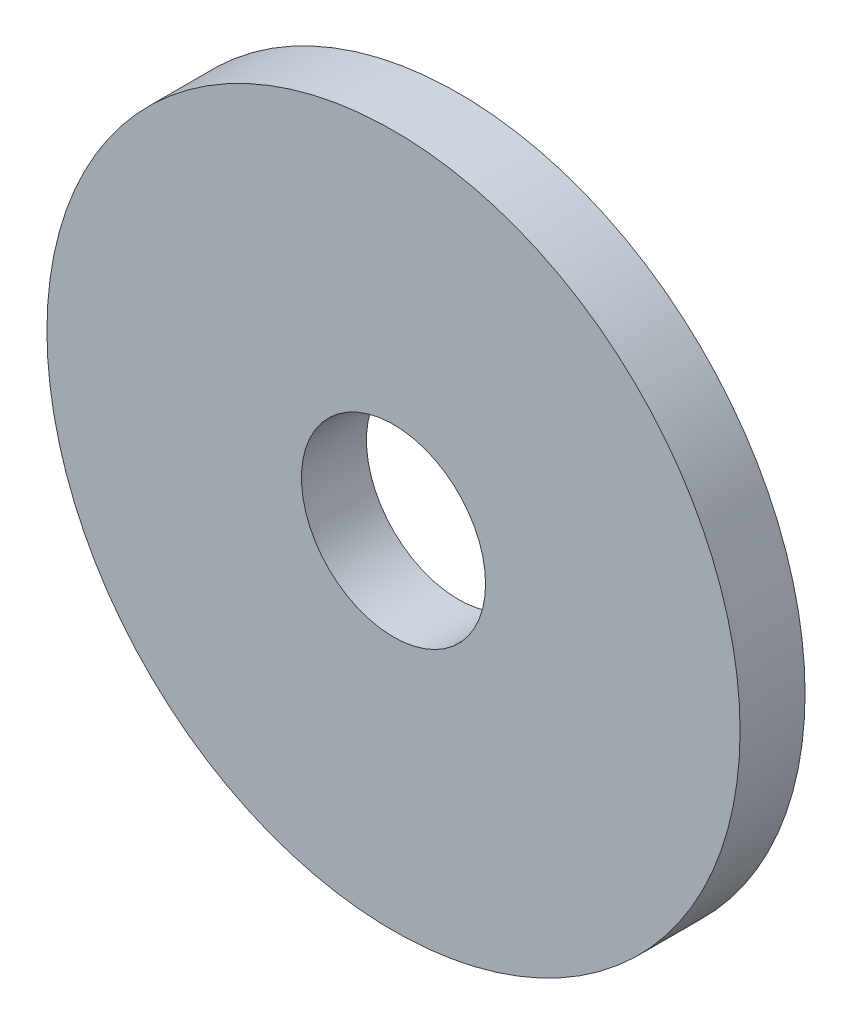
ISO-10303-21;
HEADER;
FILE_DESCRIPTION(('STEP AP214'),'2;1');
FILE_NAME('part.step','',(''),(''),'','','');
FILE_SCHEMA(('AUTOMOTIVE_DESIGN { 1 0 10303 214 1 1 1 1 }'));
ENDSEC;
DATA;
#1=APPLICATION_CONTEXT('core data for automotive mechanical design processes');
#2=APPLICATION_PROTOCOL_DEFINITION('international standard','automotive_design',2000,#1);
#3=PRODUCT_CONTEXT('',#1,'mechanical');
#4=PRODUCT('Part','Part','',(#3));
#5=PRODUCT_RELATED_PRODUCT_CATEGORY('part','',(#4));
#6=PRODUCT_DEFINITION_FORMATION('','',#4);
#7=PRODUCT_DEFINITION_CONTEXT('part definition',#1,'design');
#8=PRODUCT_DEFINITION('design','',#6,#7);
#9=PRODUCT_DEFINITION_SHAPE('','',#8);
#10=(LENGTH_UNIT() NAMED_UNIT(*) SI_UNIT(.MILLI.,.METRE.));
#11=(NAMED_UNIT(*) PLANE_ANGLE_UNIT() SI_UNIT($,.RADIAN.));
#12=(NAMED_UNIT(*) SI_UNIT($,.STERADIAN.) SOLID_ANGLE_UNIT());
#13=UNCERTAINTY_MEASURE_WITH_UNIT(LENGTH_MEASURE(1.E-05),#10,'distance_accuracy_value','');
#14=(GEOMETRIC_REPRESENTATION_CONTEXT(3) GLOBAL_UNCERTAINTY_ASSIGNED_CONTEXT((#13)) GLOBAL_UNIT_ASSIGNED_CONTEXT((#10,
#11,#12)) REPRESENTATION_CONTEXT('',''));
#15=CARTESIAN_POINT('',(0.,0.,0.));
#16=DIRECTION('',(0.,0.,1.));
#17=DIRECTION('',(1.,0.,0.));
#18=AXIS2_PLACEMENT_3D('',#15,#16,#17);
#19=CARTESIAN_POINT('',(0.,0.,3.));
#20=DIRECTION('',(0.,0.,1.));
#21=DIRECTION('',(1.,0.,0.));
#22=AXIS2_PLACEMENT_3D('',#19,#20,#21);
#23=PLANE('',#22);
#24=CARTESIAN_POINT('',(0.,0.,3.));
#25=DIRECTION('',(0.,0.,1.));
#26=DIRECTION('',(1.,0.,0.));
#27=AXIS2_PLACEMENT_3D('',#24,#25,#26);
#28=CIRCLE('',#27,16.);
#29=CARTESIAN_POINT('',(16.,0.,3.));
#30=VERTEX_POINT('',#29);
#31=EDGE_CURVE('E10',#30,#30,#28,.T.);
#32=ORIENTED_EDGE('',*,*,#31,.T.);
#33=EDGE_LOOP('',(#32));
#34=FACE_BOUND('',#33,.T.);
#35=CARTESIAN_POINT('',(0.,0.,3.));
#36=DIRECTION('',(0.,0.,1.));
#37=DIRECTION('',(1.,0.,0.));
#38=AXIS2_PLACEMENT_3D('',#35,#36,#37);
#39=CIRCLE('',#38,4.25);
#40=CARTESIAN_POINT('',(4.25,0.,3.));
#41=VERTEX_POINT('',#40);
#42=EDGE_CURVE('E45',#41,#41,#39,.T.);
#43=ORIENTED_EDGE('',*,*,#42,.F.);
#44=EDGE_LOOP('',(#43));
#45=FACE_BOUND('',#44,.T.);
#46=ADVANCED_FACE('F34',(#34,#45),#23,.T.);
#47=CARTESIAN_POINT('',(0.,0.,0.));
#48=DIRECTION('',(0.,0.,1.));
#49=DIRECTION('',(1.,0.,0.));
#50=AXIS2_PLACEMENT_3D('',#47,#48,#49);
#51=PLANE('',#50);
#52=CARTESIAN_POINT('',(0.,0.,0.));
#53=DIRECTION('',(0.,0.,1.));
#54=DIRECTION('',(1.,0.,0.));
#55=AXIS2_PLACEMENT_3D('',#52,#53,#54);
#56=CIRCLE('',#55,16.);
#57=CARTESIAN_POINT('',(16.,0.,0.));
#58=VERTEX_POINT('',#57);
#59=EDGE_CURVE('E38',#58,#58,#56,.T.);
#60=ORIENTED_EDGE('',*,*,#59,.F.);
#61=EDGE_LOOP('',(#60));
#62=FACE_BOUND('',#61,.T.);
#63=CARTESIAN_POINT('',(0.,0.,0.));
#64=DIRECTION('',(0.,0.,1.));
#65=DIRECTION('',(1.,0.,0.));
#66=AXIS2_PLACEMENT_3D('',#63,#64,#65);
#67=CIRCLE('',#66,4.25);
#68=CARTESIAN_POINT('',(4.25,0.,0.));
#69=VERTEX_POINT('',#68);
#70=EDGE_CURVE('E47',#69,#69,#67,.T.);
#71=ORIENTED_EDGE('',*,*,#70,.T.);
#72=EDGE_LOOP('',(#71));
#73=FACE_BOUND('',#72,.T.);
#74=ADVANCED_FACE('F57',(#62,#73),#51,.F.);
#75=CARTESIAN_POINT('',(0.,0.,3.));
#76=DIRECTION('',(0.,0.,-1.));
#77=DIRECTION('',(-1.,0.,0.));
#78=AXIS2_PLACEMENT_3D('',#75,#76,#77);
#79=CYLINDRICAL_SURFACE('',#78,16.);
#80=ORIENTED_EDGE('',*,*,#31,.F.);
#81=EDGE_LOOP('',(#80));
#82=FACE_BOUND('',#81,.T.);
#83=ORIENTED_EDGE('',*,*,#59,.T.);
#84=EDGE_LOOP('',(#83));
#85=FACE_BOUND('',#84,.T.);
#86=ADVANCED_FACE('F36',(#82,#85),#79,.T.);
#87=CARTESIAN_POINT('',(0.,0.,3.));
#88=DIRECTION('',(0.,0.,-1.));
#89=DIRECTION('',(-1.,0.,0.));
#90=AXIS2_PLACEMENT_3D('',#87,#88,#89);
#91=CYLINDRICAL_SURFACE('',#90,4.25);
#92=ORIENTED_EDGE('',*,*,#42,.T.);
#93=EDGE_LOOP('',(#92));
#94=FACE_BOUND('',#93,.T.);
#95=ORIENTED_EDGE('',*,*,#70,.F.);
#96=EDGE_LOOP('',(#95));
#97=FACE_BOUND('',#96,.T.);
#98=ADVANCED_FACE('F53',(#94,#97),#91,.F.);
#99=CLOSED_SHELL('',(#46,#74,#86,#98));
#100=MANIFOLD_SOLID_BREP('B2',#99);
#101=ADVANCED_BREP_SHAPE_REPRESENTATION('',(#18,#100),#14);
#102=SHAPE_DEFINITION_REPRESENTATION(#9,#101);
ENDSEC;
END-ISO-10303-21;
